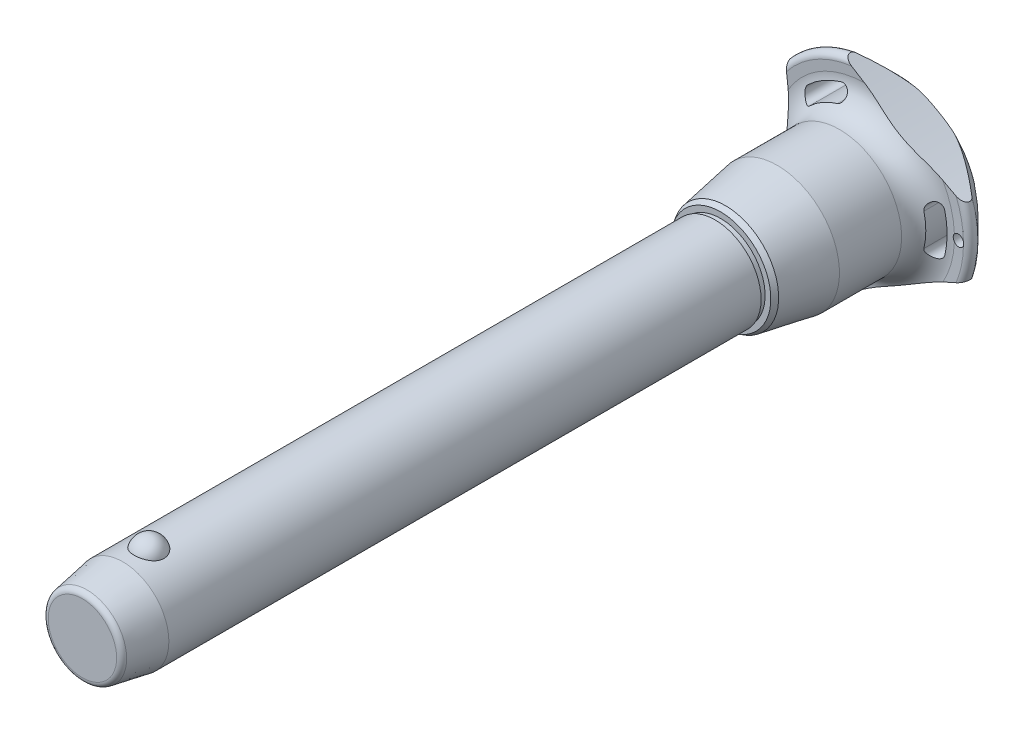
from build123d import *

# Parameters (mm, degrees)
SKETCH1_R           = 12.5
BOSS_EXTRUDE1_DEPTH = 150
SKETCH2_R           = 10
BOSS_EXTRUDE2_DEPTH = 50.7
BOSS_EXTRUDE3_START = 22
SKETCH1_2_R         = 12.5
BOSS_EXTRUDE3_DEPTH = 22
CHAMFER1_SIZE       = 11
CHAMFER1_SIZE2      = 1.939596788
FILLET1_R           = 1.5
SKETCH6_R           = 176.92625
CUT_EXTRUDE1_DEPTH  = 205.721493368
CIRPATTERN1_COUNT   = 3
SKETCH7_R           = 1.5
CUT_EXTRUDE2_DEPTH  = 205.647121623


with BuildPart() as part:
    # Sketch1 → Boss-Extrude1 (new body)
    with BuildSketch(Plane.XY):
        Circle(SKETCH1_R)
    extrude(amount=-BOSS_EXTRUDE1_DEPTH)

    # Sketch2 → Boss-Extrude2 (add)
    with BuildSketch(Plane(origin=(0, 0, -150), x_dir=(-1, 0, 0), z_dir=(0, 0, -1))):
        with Locations(Location((0, 0, 0), (0, 0, 180))):
            Circle(SKETCH2_R)
    extrude(amount=BOSS_EXTRUDE2_DEPTH)

    # Sketch3 → Revolve1 (revolve)
    with BuildSketch(Plane(origin=(0, 0, 0), x_dir=(0, 0, -1), z_dir=(1, 0, 0))):
        with BuildLine():
            Line((-3.957271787, 15.4), (-3.957271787, 7.1))
            ThreePointArc((-3.957271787, 7.1), (0.192728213, 11.25), (-3.957271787, 15.4))
        make_face()
        with BuildLine():
            Line((-3.957271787, -7.1), (-3.957271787, -15.4))
            ThreePointArc((-3.957271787, -15.4), (0.192728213, -11.25), (-3.957271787, -7.1))
        make_face()
    revolve(axis=Axis((0, -7.1, 3.957271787), (0, 1, 0)))

    # Sketch1_2 → Boss-Extrude3 (add)
    with BuildSketch(Plane.XY.offset(BOSS_EXTRUDE3_START)):
        Circle(SKETCH1_2_R)
    extrude(amount=-BOSS_EXTRUDE3_DEPTH)

    # Chamfer1
    chamfer1_edges = [part.edges().sort_by_distance(p)[0] for p in [
        (-12.5, 0, 22),
    ]]
    chamfer1_side = [part.faces().sort_by_distance(p)[0] for p in [
        (-12.5, 0, -64),
    ]]
    chamfer(chamfer1_edges, length=CHAMFER1_SIZE, length2=CHAMFER1_SIZE2, reference=chamfer1_side[0])

    # Fillet1
    fillet1_edges = [part.edges().sort_by_distance(p)[0] for p in [
        (-10.560403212, 0, 22),
        (-10, 0, -200.7),
    ]]
    fillet(fillet1_edges, radius=FILLET1_R)

    # Sketch4 → Revolve2 (revolve)
    with BuildSketch(Plane(origin=(0, 0, 0), x_dir=(0, 0, -1), z_dir=(1, 0, 0)), mode=Mode.PRIVATE) as revolve2_sk:
        Polygon((150, 0), (150, 12.089202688), (151.5, 12.089202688), (151.5, 13.644437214), (152.846872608, 14.422054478), (166.9, 16.9), (183.8, 16.9), (183.8, 0), align=None)
    revolve(revolve2_sk.sketch.rotate(Axis((0, 0, -183.8), (0, 0, 1)), 90), axis=Axis((0, 0, -183.8), (0, 0, 1)))

    # Sketch5 → Revolve3 (revolve)
    with BuildSketch(Plane(origin=(0, 0, 0), x_dir=(0, 0, -1), z_dir=(1, 0, 0)), mode=Mode.PRIVATE) as revolve3_sk:
        with BuildLine():
            Line((190.790129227, 24.271609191), (190.652256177, 26.865060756))
            ThreePointArc((190.652256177, 26.865060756), (191.598671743, 28.411427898), (193.38137085, 28.08137085))
            Line((193.38137085, 28.08137085), (199.763226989, 21.69951471))
            ThreePointArc((199.763226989, 21.69951471), (200.7, 19.381044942), (199.683055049, 17.096604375))
            ThreePointArc((199.683055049, 17.096604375), (194.18864484, 9.321268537), (192.25, 0))
            Line((192.25, 0), (183.8, 0))
            Line((183.8, 0), (183.8, 16.9))
            ThreePointArc((183.8, 16.9), (188.879432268, 19.083427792), (190.790129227, 24.271609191))
        make_face()
    revolve(revolve3_sk.sketch.rotate(Axis((0, 0, -192.25), (0, 0, 1)), 90), axis=Axis((0, 0, -192.25), (0, 0, 1)))

    # Sketch6 → Cut-Extrude1 (cut, through all)
    with BuildSketch(Plane.XY):
        with Locations((-197.42625, 0)):
            Circle(SKETCH6_R)
        with BuildLine():
            ThreePointArc((21.802992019, -5.260839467), (22.428706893, 0), (21.802992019, 5.260839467))
            ThreePointArc((21.802992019, 5.260839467), (19.579234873, 6.620060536), (18.220013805, 4.39630339))
            ThreePointArc((18.220013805, 4.39630339), (18.742902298, 0), (18.220013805, -4.39630339))
            ThreePointArc((18.220013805, -4.39630339), (19.579234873, -6.620060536), (21.802992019, -5.260839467))
        make_face()
    cut_extrude1 = extrude(amount=-CUT_EXTRUDE1_DEPTH, mode=Mode.SUBTRACT)

    # CirPattern1: Cut-Extrude1 ×3 about axis
    cirpattern1_axis = Axis((0, 0, 0), (0, 0, 1))
    for i in range(1, CIRPATTERN1_COUNT):
        add(cut_extrude1.rotate(cirpattern1_axis, i * 360 / CIRPATTERN1_COUNT), mode=Mode.SUBTRACT)

    # Sketch7 → Cut-Extrude2 (cut, through all)
    with BuildSketch(Plane.XY):
        with Locations(Location((25.428706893, 0, 0), (0, 0, 17.230769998))):
            Circle(SKETCH7_R)
    extrude(amount=-CUT_EXTRUDE2_DEPTH, mode=Mode.SUBTRACT)


solid = part.part
